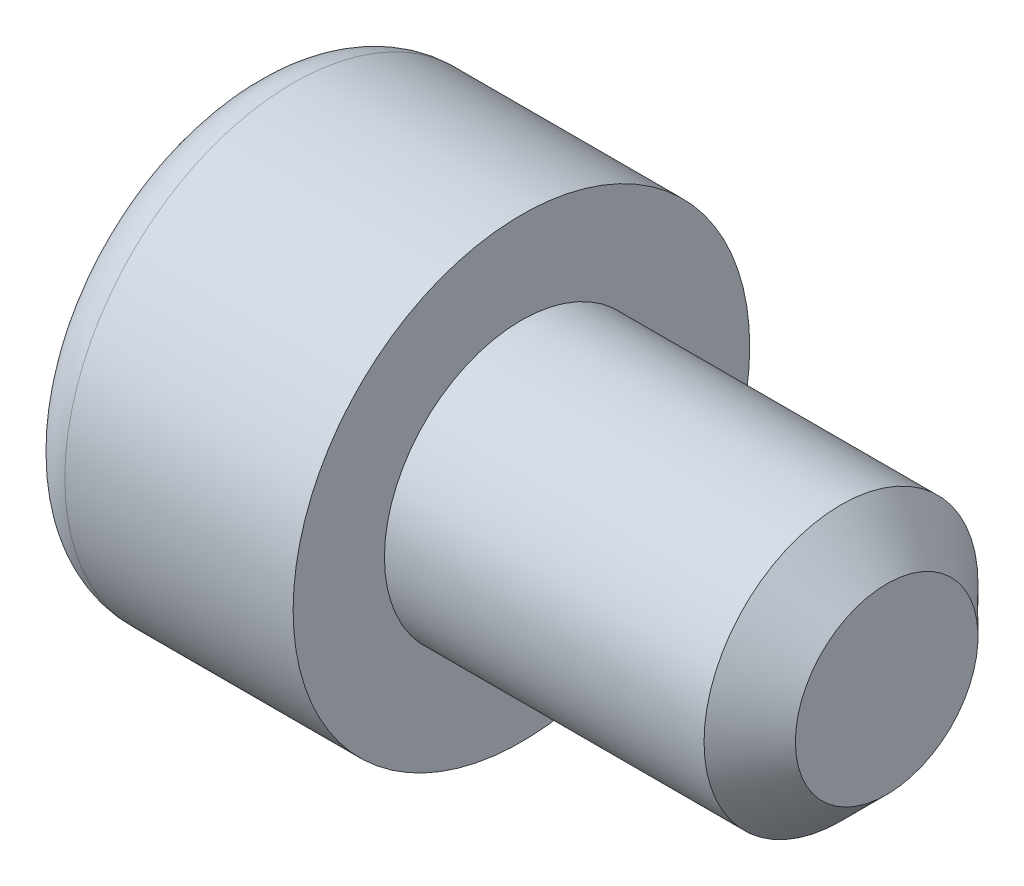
ISO-10303-21;
HEADER;
FILE_DESCRIPTION(('STEP AP214'),'2;1');
FILE_NAME('part.step','',(''),(''),'','','');
FILE_SCHEMA(('AUTOMOTIVE_DESIGN { 1 0 10303 214 1 1 1 1 }'));
ENDSEC;
DATA;
#1=APPLICATION_CONTEXT('core data for automotive mechanical design processes');
#2=APPLICATION_PROTOCOL_DEFINITION('international standard','automotive_design',2000,#1);
#3=PRODUCT_CONTEXT('',#1,'mechanical');
#4=PRODUCT('Part','Part','',(#3));
#5=PRODUCT_RELATED_PRODUCT_CATEGORY('part','',(#4));
#6=PRODUCT_DEFINITION_FORMATION('','',#4);
#7=PRODUCT_DEFINITION_CONTEXT('part definition',#1,'design');
#8=PRODUCT_DEFINITION('design','',#6,#7);
#9=PRODUCT_DEFINITION_SHAPE('','',#8);
#10=(LENGTH_UNIT() NAMED_UNIT(*) SI_UNIT(.MILLI.,.METRE.));
#11=(NAMED_UNIT(*) PLANE_ANGLE_UNIT() SI_UNIT($,.RADIAN.));
#12=(NAMED_UNIT(*) SI_UNIT($,.STERADIAN.) SOLID_ANGLE_UNIT());
#13=UNCERTAINTY_MEASURE_WITH_UNIT(LENGTH_MEASURE(1.E-05),#10,'distance_accuracy_value','');
#14=(GEOMETRIC_REPRESENTATION_CONTEXT(3) GLOBAL_UNCERTAINTY_ASSIGNED_CONTEXT((#13)) GLOBAL_UNIT_ASSIGNED_CONTEXT((#10,
#11,#12)) REPRESENTATION_CONTEXT('',''));
#15=CARTESIAN_POINT('',(0.,0.,0.));
#16=DIRECTION('',(0.,0.,1.));
#17=DIRECTION('',(1.,0.,0.));
#18=AXIS2_PLACEMENT_3D('',#15,#16,#17);
#19=CARTESIAN_POINT('',(-6.,0.,0.));
#20=DIRECTION('',(-1.,0.,0.));
#21=DIRECTION('',(0.,0.,1.));
#22=AXIS2_PLACEMENT_3D('',#19,#20,#21);
#23=PLANE('',#22);
#24=CARTESIAN_POINT('',(-6.,0.,0.));
#25=DIRECTION('',(-1.,0.,0.));
#26=DIRECTION('',(0.,0.,1.));
#27=AXIS2_PLACEMENT_3D('',#24,#25,#26);
#28=CIRCLE('',#27,4.);
#29=CARTESIAN_POINT('',(-6.,0.,4.));
#30=VERTEX_POINT('',#29);
#31=EDGE_CURVE('E141',#30,#30,#28,.T.);
#32=ORIENTED_EDGE('',*,*,#31,.T.);
#33=EDGE_LOOP('',(#32));
#34=FACE_BOUND('',#33,.T.);
#35=DIRECTION('',(0.,0.909373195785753,-0.415981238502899));
#36=VECTOR('',#35,1.);
#37=CARTESIAN_POINT('',(-6.,-2.19361678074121,-1.89600279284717));
#38=LINE('',#37,#36);
#39=CARTESIAN_POINT('',(-6.,-2.19361678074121,-1.89600279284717));
#40=VERTEX_POINT('',#39);
#41=CARTESIAN_POINT('',(-6.,0.,-2.89944497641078));
#42=VERTEX_POINT('',#41);
#43=EDGE_CURVE('E130',#40,#42,#38,.T.);
#44=ORIENTED_EDGE('',*,*,#43,.T.);
#45=DIRECTION('',(0.,0.862233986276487,0.506510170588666));
#46=VECTOR('',#45,1.);
#47=CARTESIAN_POINT('',(-6.,0.,-2.89944497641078));
#48=LINE('',#47,#46);
#49=CARTESIAN_POINT('',(-6.,2.53255085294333,-1.41172495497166));
#50=VERTEX_POINT('',#49);
#51=EDGE_CURVE('E50',#42,#50,#48,.T.);
#52=ORIENTED_EDGE('',*,*,#51,.T.);
#53=DIRECTION('',(0.,-0.101933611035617,0.994791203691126));
#54=VECTOR('',#53,1.);
#55=CARTESIAN_POINT('',(-6.,2.53255085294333,-1.41172495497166));
#56=LINE('',#55,#54);
#57=CARTESIAN_POINT('',(-6.,2.19361678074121,1.89600279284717));
#58=VERTEX_POINT('',#57);
#59=EDGE_CURVE('E121',#50,#58,#56,.T.);
#60=ORIENTED_EDGE('',*,*,#59,.T.);
#61=DIRECTION('',(0.,-0.909373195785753,0.415981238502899));
#62=VECTOR('',#61,1.);
#63=CARTESIAN_POINT('',(-6.,2.19361678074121,1.89600279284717));
#64=LINE('',#63,#62);
#65=CARTESIAN_POINT('',(-6.,0.,2.89944497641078));
#66=VERTEX_POINT('',#65);
#67=EDGE_CURVE('E124',#58,#66,#64,.T.);
#68=ORIENTED_EDGE('',*,*,#67,.T.);
#69=DIRECTION('',(0.,-0.862233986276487,-0.506510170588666));
#70=VECTOR('',#69,1.);
#71=CARTESIAN_POINT('',(-6.,0.,2.89944497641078));
#72=LINE('',#71,#70);
#73=CARTESIAN_POINT('',(-6.,-2.53255085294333,1.41172495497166));
#74=VERTEX_POINT('',#73);
#75=EDGE_CURVE('E127',#66,#74,#72,.T.);
#76=ORIENTED_EDGE('',*,*,#75,.T.);
#77=DIRECTION('',(0.,0.101933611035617,-0.994791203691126));
#78=VECTOR('',#77,1.);
#79=CARTESIAN_POINT('',(-6.,-2.53255085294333,1.41172495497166));
#80=LINE('',#79,#78);
#81=EDGE_CURVE('E111',#74,#40,#80,.T.);
#82=ORIENTED_EDGE('',*,*,#81,.T.);
#83=EDGE_LOOP('',(#44,#52,#60,#68,#76,#82));
#84=FACE_BOUND('',#83,.T.);
#85=ADVANCED_FACE('F35',(#34,#84),#23,.T.);
#86=CARTESIAN_POINT('',(-5.,0.,0.));
#87=DIRECTION('',(-1.,0.,0.));
#88=DIRECTION('',(0.,0.,1.));
#89=AXIS2_PLACEMENT_3D('',#86,#87,#88);
#90=TOROIDAL_SURFACE('',#89,4.,1.);
#91=CARTESIAN_POINT('',(-5.,0.,0.));
#92=DIRECTION('',(-1.,0.,0.));
#93=DIRECTION('',(0.,0.,1.));
#94=AXIS2_PLACEMENT_3D('',#91,#92,#93);
#95=CIRCLE('',#94,5.);
#96=CARTESIAN_POINT('',(-5.,0.,5.));
#97=VERTEX_POINT('',#96);
#98=EDGE_CURVE('E11',#97,#97,#95,.T.);
#99=ORIENTED_EDGE('',*,*,#98,.T.);
#100=EDGE_LOOP('',(#99));
#101=FACE_BOUND('',#100,.T.);
#102=ORIENTED_EDGE('',*,*,#31,.F.);
#103=EDGE_LOOP('',(#102));
#104=FACE_BOUND('',#103,.T.);
#105=ADVANCED_FACE('F37',(#101,#104),#90,.T.);
#106=CARTESIAN_POINT('',(-28.5761966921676,0.,0.));
#107=DIRECTION('',(-1.,0.,0.));
#108=DIRECTION('',(0.,0.,1.));
#109=AXIS2_PLACEMENT_3D('',#106,#107,#108);
#110=CYLINDRICAL_SURFACE('',#109,5.);
#111=CARTESIAN_POINT('',(0.,0.,0.));
#112=DIRECTION('',(-1.,0.,0.));
#113=DIRECTION('',(0.,0.,1.));
#114=AXIS2_PLACEMENT_3D('',#111,#112,#113);
#115=CIRCLE('',#114,5.);
#116=CARTESIAN_POINT('',(0.,0.,5.));
#117=VERTEX_POINT('',#116);
#118=EDGE_CURVE('E43',#117,#117,#115,.T.);
#119=ORIENTED_EDGE('',*,*,#118,.T.);
#120=EDGE_LOOP('',(#119));
#121=FACE_BOUND('',#120,.T.);
#122=ORIENTED_EDGE('',*,*,#98,.F.);
#123=EDGE_LOOP('',(#122));
#124=FACE_BOUND('',#123,.T.);
#125=ADVANCED_FACE('F155',(#121,#124),#110,.T.);
#126=CARTESIAN_POINT('',(0.,5.,0.));
#127=DIRECTION('',(1.,0.,0.));
#128=DIRECTION('',(0.,0.,-1.));
#129=AXIS2_PLACEMENT_3D('',#126,#127,#128);
#130=PLANE('',#129);
#131=CARTESIAN_POINT('',(0.,0.,0.));
#132=DIRECTION('',(-1.,0.,0.));
#133=DIRECTION('',(0.,0.,1.));
#134=AXIS2_PLACEMENT_3D('',#131,#132,#133);
#135=CIRCLE('',#134,2.99999999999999);
#136=CARTESIAN_POINT('',(0.,0.,2.99999999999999));
#137=VERTEX_POINT('',#136);
#138=EDGE_CURVE('E150',#137,#137,#135,.T.);
#139=ORIENTED_EDGE('',*,*,#138,.T.);
#140=EDGE_LOOP('',(#139));
#141=FACE_BOUND('',#140,.T.);
#142=ORIENTED_EDGE('',*,*,#118,.F.);
#143=EDGE_LOOP('',(#142));
#144=FACE_BOUND('',#143,.T.);
#145=ADVANCED_FACE('F158',(#141,#144),#130,.T.);
#146=CARTESIAN_POINT('',(-28.5761966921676,0.,0.));
#147=DIRECTION('',(-1.,0.,0.));
#148=DIRECTION('',(0.,0.,1.));
#149=AXIS2_PLACEMENT_3D('',#146,#147,#148);
#150=CYLINDRICAL_SURFACE('',#149,2.99999999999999);
#151=CARTESIAN_POINT('',(7.,0.,0.));
#152=DIRECTION('',(-1.,0.,0.));
#153=DIRECTION('',(0.,0.,1.));
#154=AXIS2_PLACEMENT_3D('',#151,#152,#153);
#155=CIRCLE('',#154,2.99999999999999);
#156=CARTESIAN_POINT('',(7.,0.,2.99999999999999));
#157=VERTEX_POINT('',#156);
#158=EDGE_CURVE('E147',#157,#157,#155,.T.);
#159=ORIENTED_EDGE('',*,*,#158,.T.);
#160=EDGE_LOOP('',(#159));
#161=FACE_BOUND('',#160,.T.);
#162=ORIENTED_EDGE('',*,*,#138,.F.);
#163=EDGE_LOOP('',(#162));
#164=FACE_BOUND('',#163,.T.);
#165=ADVANCED_FACE('F160',(#161,#164),#150,.T.);
#166=CARTESIAN_POINT('',(7.,0.,0.));
#167=DIRECTION('',(-1.,0.,0.));
#168=DIRECTION('',(0.,0.,1.));
#169=AXIS2_PLACEMENT_3D('',#166,#167,#168);
#170=CONICAL_SURFACE('',#169,2.99999999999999,0.785398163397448);
#171=CARTESIAN_POINT('',(8.,0.,0.));
#172=DIRECTION('',(-1.,0.,0.));
#173=DIRECTION('',(0.,0.,1.));
#174=AXIS2_PLACEMENT_3D('',#171,#172,#173);
#175=CIRCLE('',#174,1.99999999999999);
#176=CARTESIAN_POINT('',(8.,0.,1.99999999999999));
#177=VERTEX_POINT('',#176);
#178=EDGE_CURVE('E144',#177,#177,#175,.T.);
#179=ORIENTED_EDGE('',*,*,#178,.T.);
#180=EDGE_LOOP('',(#179));
#181=FACE_BOUND('',#180,.T.);
#182=ORIENTED_EDGE('',*,*,#158,.F.);
#183=EDGE_LOOP('',(#182));
#184=FACE_BOUND('',#183,.T.);
#185=ADVANCED_FACE('F167',(#181,#184),#170,.T.);
#186=CARTESIAN_POINT('',(8.,1.99999999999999,0.));
#187=DIRECTION('',(1.,0.,0.));
#188=DIRECTION('',(0.,0.,-1.));
#189=AXIS2_PLACEMENT_3D('',#186,#187,#188);
#190=PLANE('',#189);
#191=ORIENTED_EDGE('',*,*,#178,.F.);
#192=EDGE_LOOP('',(#191));
#193=FACE_BOUND('',#192,.T.);
#194=ADVANCED_FACE('F182',(#193),#190,.T.);
#195=CARTESIAN_POINT('',(-3.,0.,-2.89944497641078));
#196=DIRECTION('',(0.,-0.506510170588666,0.862233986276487));
#197=DIRECTION('',(0.,-0.862233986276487,-0.506510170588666));
#198=AXIS2_PLACEMENT_3D('',#195,#196,#197);
#199=PLANE('',#198);
#200=ORIENTED_EDGE('',*,*,#51,.F.);
#201=DIRECTION('',(-1.,0.,0.));
#202=VECTOR('',#201,1.);
#203=CARTESIAN_POINT('',(-3.,0.,-2.89944497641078));
#204=LINE('',#203,#202);
#205=CARTESIAN_POINT('',(-3.,0.,-2.89944497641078));
#206=VERTEX_POINT('',#205);
#207=EDGE_CURVE('E116',#206,#42,#204,.T.);
#208=ORIENTED_EDGE('',*,*,#207,.F.);
#209=DIRECTION('',(0.,0.862233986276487,0.506510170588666));
#210=VECTOR('',#209,1.);
#211=CARTESIAN_POINT('',(-3.,0.,-2.89944497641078));
#212=LINE('',#211,#210);
#213=CARTESIAN_POINT('',(-3.,2.53255085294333,-1.41172495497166));
#214=VERTEX_POINT('',#213);
#215=EDGE_CURVE('E133',#206,#214,#212,.T.);
#216=ORIENTED_EDGE('',*,*,#215,.T.);
#217=DIRECTION('',(-1.,0.,0.));
#218=VECTOR('',#217,1.);
#219=CARTESIAN_POINT('',(-3.,2.53255085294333,-1.41172495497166));
#220=LINE('',#219,#218);
#221=EDGE_CURVE('E139',#214,#50,#220,.T.);
#222=ORIENTED_EDGE('',*,*,#221,.T.);
#223=EDGE_LOOP('',(#200,#208,#216,#222));
#224=FACE_BOUND('',#223,.T.);
#225=ADVANCED_FACE('F180',(#224),#199,.T.);
#226=CARTESIAN_POINT('',(-3.,2.53255085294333,-1.41172495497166));
#227=DIRECTION('',(0.,-0.994791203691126,-0.101933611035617));
#228=DIRECTION('',(0.,0.101933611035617,-0.994791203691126));
#229=AXIS2_PLACEMENT_3D('',#226,#227,#228);
#230=PLANE('',#229);
#231=ORIENTED_EDGE('',*,*,#59,.F.);
#232=ORIENTED_EDGE('',*,*,#221,.F.);
#233=DIRECTION('',(0.,-0.101933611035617,0.994791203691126));
#234=VECTOR('',#233,1.);
#235=CARTESIAN_POINT('',(-3.,2.53255085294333,-1.41172495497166));
#236=LINE('',#235,#234);
#237=CARTESIAN_POINT('',(-3.,2.19361678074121,1.89600279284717));
#238=VERTEX_POINT('',#237);
#239=EDGE_CURVE('E89',#214,#238,#236,.T.);
#240=ORIENTED_EDGE('',*,*,#239,.T.);
#241=DIRECTION('',(-1.,0.,0.));
#242=VECTOR('',#241,1.);
#243=CARTESIAN_POINT('',(-3.,2.19361678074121,1.89600279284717));
#244=LINE('',#243,#242);
#245=EDGE_CURVE('E137',#238,#58,#244,.T.);
#246=ORIENTED_EDGE('',*,*,#245,.T.);
#247=EDGE_LOOP('',(#231,#232,#240,#246));
#248=FACE_BOUND('',#247,.T.);
#249=ADVANCED_FACE('F207',(#248),#230,.T.);
#250=CARTESIAN_POINT('',(-3.,2.19361678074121,1.89600279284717));
#251=DIRECTION('',(0.,-0.415981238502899,-0.909373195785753));
#252=DIRECTION('',(0.,0.909373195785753,-0.415981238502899));
#253=AXIS2_PLACEMENT_3D('',#250,#251,#252);
#254=PLANE('',#253);
#255=ORIENTED_EDGE('',*,*,#67,.F.);
#256=ORIENTED_EDGE('',*,*,#245,.F.);
#257=DIRECTION('',(0.,-0.909373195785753,0.415981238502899));
#258=VECTOR('',#257,1.);
#259=CARTESIAN_POINT('',(-3.,2.19361678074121,1.89600279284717));
#260=LINE('',#259,#258);
#261=CARTESIAN_POINT('',(-3.,0.,2.89944497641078));
#262=VERTEX_POINT('',#261);
#263=EDGE_CURVE('E107',#238,#262,#260,.T.);
#264=ORIENTED_EDGE('',*,*,#263,.T.);
#265=DIRECTION('',(-1.,0.,0.));
#266=VECTOR('',#265,1.);
#267=CARTESIAN_POINT('',(-3.,0.,2.89944497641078));
#268=LINE('',#267,#266);
#269=EDGE_CURVE('E104',#262,#66,#268,.T.);
#270=ORIENTED_EDGE('',*,*,#269,.T.);
#271=EDGE_LOOP('',(#255,#256,#264,#270));
#272=FACE_BOUND('',#271,.T.);
#273=ADVANCED_FACE('F213',(#272),#254,.T.);
#274=CARTESIAN_POINT('',(-3.,0.,2.89944497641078));
#275=DIRECTION('',(0.,0.506510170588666,-0.862233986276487));
#276=DIRECTION('',(0.,0.862233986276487,0.506510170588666));
#277=AXIS2_PLACEMENT_3D('',#274,#275,#276);
#278=PLANE('',#277);
#279=ORIENTED_EDGE('',*,*,#75,.F.);
#280=ORIENTED_EDGE('',*,*,#269,.F.);
#281=DIRECTION('',(0.,-0.862233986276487,-0.506510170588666));
#282=VECTOR('',#281,1.);
#283=CARTESIAN_POINT('',(-3.,0.,2.89944497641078));
#284=LINE('',#283,#282);
#285=CARTESIAN_POINT('',(-3.,-2.53255085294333,1.41172495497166));
#286=VERTEX_POINT('',#285);
#287=EDGE_CURVE('E99',#262,#286,#284,.T.);
#288=ORIENTED_EDGE('',*,*,#287,.T.);
#289=DIRECTION('',(-1.,0.,0.));
#290=VECTOR('',#289,1.);
#291=CARTESIAN_POINT('',(-3.,-2.53255085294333,1.41172495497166));
#292=LINE('',#291,#290);
#293=EDGE_CURVE('E103',#286,#74,#292,.T.);
#294=ORIENTED_EDGE('',*,*,#293,.T.);
#295=EDGE_LOOP('',(#279,#280,#288,#294));
#296=FACE_BOUND('',#295,.T.);
#297=ADVANCED_FACE('F102',(#296),#278,.T.);
#298=CARTESIAN_POINT('',(-3.,-2.53255085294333,1.41172495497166));
#299=DIRECTION('',(0.,0.994791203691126,0.101933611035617));
#300=DIRECTION('',(0.,-0.101933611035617,0.994791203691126));
#301=AXIS2_PLACEMENT_3D('',#298,#299,#300);
#302=PLANE('',#301);
#303=ORIENTED_EDGE('',*,*,#81,.F.);
#304=ORIENTED_EDGE('',*,*,#293,.F.);
#305=DIRECTION('',(0.,0.101933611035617,-0.994791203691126));
#306=VECTOR('',#305,1.);
#307=CARTESIAN_POINT('',(-3.,-2.53255085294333,1.41172495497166));
#308=LINE('',#307,#306);
#309=CARTESIAN_POINT('',(-3.,-2.19361678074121,-1.89600279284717));
#310=VERTEX_POINT('',#309);
#311=EDGE_CURVE('E106',#286,#310,#308,.T.);
#312=ORIENTED_EDGE('',*,*,#311,.T.);
#313=DIRECTION('',(-1.,0.,0.));
#314=VECTOR('',#313,1.);
#315=CARTESIAN_POINT('',(-3.,-2.19361678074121,-1.89600279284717));
#316=LINE('',#315,#314);
#317=EDGE_CURVE('E80',#310,#40,#316,.T.);
#318=ORIENTED_EDGE('',*,*,#317,.T.);
#319=EDGE_LOOP('',(#303,#304,#312,#318));
#320=FACE_BOUND('',#319,.T.);
#321=ADVANCED_FACE('F109',(#320),#302,.T.);
#322=CARTESIAN_POINT('',(-3.,-2.19361678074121,-1.89600279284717));
#323=DIRECTION('',(0.,0.415981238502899,0.909373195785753));
#324=DIRECTION('',(0.,-0.909373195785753,0.415981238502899));
#325=AXIS2_PLACEMENT_3D('',#322,#323,#324);
#326=PLANE('',#325);
#327=ORIENTED_EDGE('',*,*,#43,.F.);
#328=ORIENTED_EDGE('',*,*,#317,.F.);
#329=DIRECTION('',(0.,0.909373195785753,-0.415981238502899));
#330=VECTOR('',#329,1.);
#331=CARTESIAN_POINT('',(-3.,-2.19361678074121,-1.89600279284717));
#332=LINE('',#331,#330);
#333=EDGE_CURVE('E58',#310,#206,#332,.T.);
#334=ORIENTED_EDGE('',*,*,#333,.T.);
#335=ORIENTED_EDGE('',*,*,#207,.T.);
#336=EDGE_LOOP('',(#327,#328,#334,#335));
#337=FACE_BOUND('',#336,.T.);
#338=ADVANCED_FACE('F233',(#337),#326,.T.);
#339=CARTESIAN_POINT('',(-3.,-1.97209002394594,-4.05792825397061));
#340=DIRECTION('',(-1.,0.,0.));
#341=DIRECTION('',(0.,0.,1.));
#342=AXIS2_PLACEMENT_3D('',#339,#340,#341);
#343=PLANE('',#342);
#344=ORIENTED_EDGE('',*,*,#215,.F.);
#345=ORIENTED_EDGE('',*,*,#333,.F.);
#346=ORIENTED_EDGE('',*,*,#311,.F.);
#347=ORIENTED_EDGE('',*,*,#287,.F.);
#348=ORIENTED_EDGE('',*,*,#263,.F.);
#349=ORIENTED_EDGE('',*,*,#239,.F.);
#350=EDGE_LOOP('',(#344,#345,#346,#347,#348,#349));
#351=FACE_BOUND('',#350,.T.);
#352=ADVANCED_FACE('F114',(#351),#343,.T.);
#353=CLOSED_SHELL('',(#85,#105,#125,#145,#165,#185,#194,#225,#249,#273,#297,#321,#338,#352));
#354=MANIFOLD_SOLID_BREP('B2',#353);
#355=ADVANCED_BREP_SHAPE_REPRESENTATION('',(#18,#354),#14);
#356=SHAPE_DEFINITION_REPRESENTATION(#9,#355);
ENDSEC;
END-ISO-10303-21;
